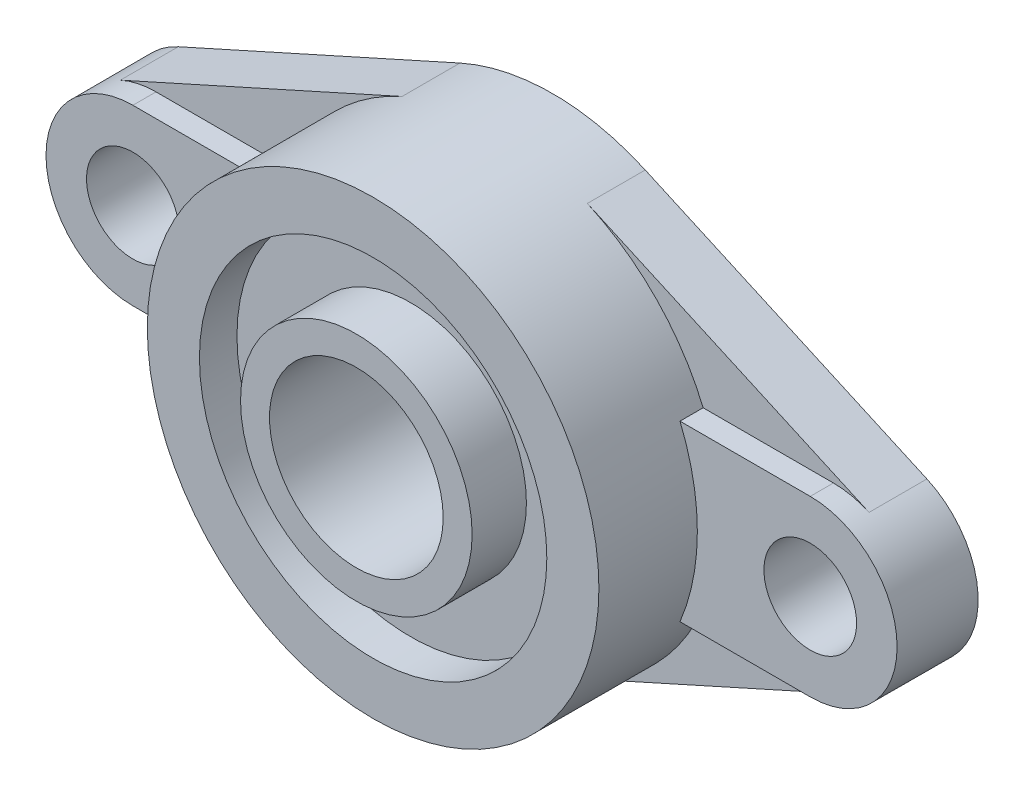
ISO-10303-21;
HEADER;
FILE_DESCRIPTION(('STEP AP214'),'2;1');
FILE_NAME('part.step','',(''),(''),'','','');
FILE_SCHEMA(('AUTOMOTIVE_DESIGN { 1 0 10303 214 1 1 1 1 }'));
ENDSEC;
DATA;
#1=APPLICATION_CONTEXT('core data for automotive mechanical design processes');
#2=APPLICATION_PROTOCOL_DEFINITION('international standard','automotive_design',2000,#1);
#3=PRODUCT_CONTEXT('',#1,'mechanical');
#4=PRODUCT('Part','Part','',(#3));
#5=PRODUCT_RELATED_PRODUCT_CATEGORY('part','',(#4));
#6=PRODUCT_DEFINITION_FORMATION('','',#4);
#7=PRODUCT_DEFINITION_CONTEXT('part definition',#1,'design');
#8=PRODUCT_DEFINITION('design','',#6,#7);
#9=PRODUCT_DEFINITION_SHAPE('','',#8);
#10=(LENGTH_UNIT() NAMED_UNIT(*) SI_UNIT(.MILLI.,.METRE.));
#11=(NAMED_UNIT(*) PLANE_ANGLE_UNIT() SI_UNIT($,.RADIAN.));
#12=(NAMED_UNIT(*) SI_UNIT($,.STERADIAN.) SOLID_ANGLE_UNIT());
#13=UNCERTAINTY_MEASURE_WITH_UNIT(LENGTH_MEASURE(1.E-05),#10,'distance_accuracy_value','');
#14=(GEOMETRIC_REPRESENTATION_CONTEXT(3) GLOBAL_UNCERTAINTY_ASSIGNED_CONTEXT((#13)) GLOBAL_UNIT_ASSIGNED_CONTEXT((#10,
#11,#12)) REPRESENTATION_CONTEXT('',''));
#15=CARTESIAN_POINT('',(0.,0.,0.));
#16=DIRECTION('',(0.,0.,1.));
#17=DIRECTION('',(1.,0.,0.));
#18=AXIS2_PLACEMENT_3D('',#15,#16,#17);
#19=CARTESIAN_POINT('',(0.,15.,33.9));
#20=DIRECTION('',(0.,0.,1.));
#21=DIRECTION('',(1.,0.,0.));
#22=AXIS2_PLACEMENT_3D('',#19,#20,#21);
#23=PLANE('',#22);
#24=CARTESIAN_POINT('',(0.,0.,33.9));
#25=DIRECTION('',(0.,0.,-1.));
#26=DIRECTION('',(-1.,0.,0.));
#27=AXIS2_PLACEMENT_3D('',#24,#25,#26);
#28=CIRCLE('',#27,20.);
#29=CARTESIAN_POINT('',(-20.,0.,33.9));
#30=VERTEX_POINT('',#29);
#31=EDGE_CURVE('E179',#30,#30,#28,.T.);
#32=ORIENTED_EDGE('',*,*,#31,.F.);
#33=EDGE_LOOP('',(#32));
#34=FACE_BOUND('',#33,.T.);
#35=CARTESIAN_POINT('',(0.,0.,33.9));
#36=DIRECTION('',(0.,0.,-1.));
#37=DIRECTION('',(1.,0.,0.));
#38=AXIS2_PLACEMENT_3D('',#35,#36,#37);
#39=CIRCLE('',#38,15.);
#40=CARTESIAN_POINT('',(15.,0.,33.9));
#41=VERTEX_POINT('',#40);
#42=EDGE_CURVE('E383',#41,#41,#39,.T.);
#43=ORIENTED_EDGE('',*,*,#42,.T.);
#44=EDGE_LOOP('',(#43));
#45=FACE_BOUND('',#44,.T.);
#46=ADVANCED_FACE('F17',(#34,#45),#23,.T.);
#47=CARTESIAN_POINT('',(0.,15.,-4.1));
#48=DIRECTION('',(0.,0.,1.));
#49=DIRECTION('',(1.,0.,0.));
#50=AXIS2_PLACEMENT_3D('',#47,#48,#49);
#51=PLANE('',#50);
#52=CARTESIAN_POINT('',(0.,0.,-4.1));
#53=DIRECTION('',(0.,0.,-1.));
#54=DIRECTION('',(-1.,0.,0.));
#55=AXIS2_PLACEMENT_3D('',#52,#53,#54);
#56=CIRCLE('',#55,20.);
#57=CARTESIAN_POINT('',(-20.,0.,-4.1));
#58=VERTEX_POINT('',#57);
#59=EDGE_CURVE('E163',#58,#58,#56,.T.);
#60=ORIENTED_EDGE('',*,*,#59,.T.);
#61=EDGE_LOOP('',(#60));
#62=FACE_BOUND('',#61,.T.);
#63=CARTESIAN_POINT('',(0.,0.,-4.1));
#64=DIRECTION('',(0.,0.,1.));
#65=DIRECTION('',(1.,0.,0.));
#66=AXIS2_PLACEMENT_3D('',#63,#64,#65);
#67=CIRCLE('',#66,15.);
#68=CARTESIAN_POINT('',(15.,0.,-4.09999999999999));
#69=VERTEX_POINT('',#68);
#70=EDGE_CURVE('E386',#69,#69,#67,.F.);
#71=ORIENTED_EDGE('',*,*,#70,.F.);
#72=EDGE_LOOP('',(#71));
#73=FACE_BOUND('',#72,.T.);
#74=ADVANCED_FACE('F396',(#62,#73),#51,.F.);
#75=CARTESIAN_POINT('',(-58.5,0.,9.99999999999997));
#76=DIRECTION('',(0.,0.,-1.));
#77=DIRECTION('',(-1.,0.,0.));
#78=AXIS2_PLACEMENT_3D('',#75,#76,#77);
#79=PLANE('',#78);
#80=CARTESIAN_POINT('',(0.,0.,10.));
#81=DIRECTION('',(0.,0.,-1.));
#82=DIRECTION('',(-1.,0.,0.));
#83=AXIS2_PLACEMENT_3D('',#80,#81,#82);
#84=CIRCLE('',#83,39.);
#85=CARTESIAN_POINT('',(-16.,-35.5668384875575,10.));
#86=VERTEX_POINT('',#85);
#87=CARTESIAN_POINT('',(-36.,-15.,9.99999999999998));
#88=VERTEX_POINT('',#87);
#89=EDGE_CURVE('E136',#86,#88,#84,.T.);
#90=ORIENTED_EDGE('',*,*,#89,.T.);
#91=DIRECTION('',(-1.,0.,0.));
#92=VECTOR('',#91,1.);
#93=CARTESIAN_POINT('',(-58.5,-15.0000000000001,9.99999999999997));
#94=LINE('',#93,#92);
#95=CARTESIAN_POINT('',(-58.5,-15.0000000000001,9.99999999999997));
#96=VERTEX_POINT('',#95);
#97=EDGE_CURVE('E193',#88,#96,#94,.T.);
#98=ORIENTED_EDGE('',*,*,#97,.T.);
#99=CARTESIAN_POINT('',(-58.5,0.,9.99999999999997));
#100=DIRECTION('',(0.,0.,-1.));
#101=DIRECTION('',(1.,0.,0.));
#102=AXIS2_PLACEMENT_3D('',#99,#100,#101);
#103=CIRCLE('',#102,15.);
#104=CARTESIAN_POINT('',(-64.6538461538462,-13.6795532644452,9.99999999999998));
#105=VERTEX_POINT('',#104);
#106=EDGE_CURVE('E139',#96,#105,#103,.T.);
#107=ORIENTED_EDGE('',*,*,#106,.T.);
#108=DIRECTION('',(-0.911970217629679,0.41025641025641,0.));
#109=VECTOR('',#108,1.);
#110=CARTESIAN_POINT('',(-64.6538461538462,-13.6795532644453,9.99999999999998));
#111=LINE('',#110,#109);
#112=EDGE_CURVE('E132',#86,#105,#111,.T.);
#113=ORIENTED_EDGE('',*,*,#112,.F.);
#114=EDGE_LOOP('',(#90,#98,#107,#113));
#115=FACE_BOUND('',#114,.T.);
#116=ADVANCED_FACE('F134',(#115),#79,.F.);
#117=CARTESIAN_POINT('',(36.,-15.,10.));
#118=VERTEX_POINT('',#117);
#119=CARTESIAN_POINT('',(16.,-35.5668384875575,10.));
#120=VERTEX_POINT('',#119);
#121=EDGE_CURVE('E160',#118,#120,#84,.T.);
#122=ORIENTED_EDGE('',*,*,#121,.T.);
#123=DIRECTION('',(-0.911970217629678,-0.410256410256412,0.));
#124=VECTOR('',#123,1.);
#125=CARTESIAN_POINT('',(64.6538461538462,-13.6795532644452,10.));
#126=LINE('',#125,#124);
#127=CARTESIAN_POINT('',(64.6538461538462,-13.6795532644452,10.));
#128=VERTEX_POINT('',#127);
#129=EDGE_CURVE('E143',#128,#120,#126,.T.);
#130=ORIENTED_EDGE('',*,*,#129,.F.);
#131=CARTESIAN_POINT('',(58.5,0.,10.));
#132=DIRECTION('',(0.,0.,-1.));
#133=DIRECTION('',(-1.,0.,0.));
#134=AXIS2_PLACEMENT_3D('',#131,#132,#133);
#135=CIRCLE('',#134,15.);
#136=CARTESIAN_POINT('',(58.5,-15.,10.));
#137=VERTEX_POINT('',#136);
#138=EDGE_CURVE('E242',#128,#137,#135,.T.);
#139=ORIENTED_EDGE('',*,*,#138,.T.);
#140=EDGE_CURVE('E189',#137,#118,#94,.T.);
#141=ORIENTED_EDGE('',*,*,#140,.T.);
#142=EDGE_LOOP('',(#122,#130,#139,#141));
#143=FACE_BOUND('',#142,.T.);
#144=ADVANCED_FACE('F358',(#143),#79,.F.);
#145=CARTESIAN_POINT('',(16.,35.5668384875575,10.));
#146=VERTEX_POINT('',#145);
#147=CARTESIAN_POINT('',(36.,15.,10.));
#148=VERTEX_POINT('',#147);
#149=EDGE_CURVE('E33',#146,#148,#84,.T.);
#150=ORIENTED_EDGE('',*,*,#149,.T.);
#151=DIRECTION('',(1.,0.,0.));
#152=VECTOR('',#151,1.);
#153=CARTESIAN_POINT('',(-58.5,15.,9.99999999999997));
#154=LINE('',#153,#152);
#155=CARTESIAN_POINT('',(58.5,15.,10.));
#156=VERTEX_POINT('',#155);
#157=EDGE_CURVE('E188',#148,#156,#154,.T.);
#158=ORIENTED_EDGE('',*,*,#157,.T.);
#159=CARTESIAN_POINT('',(64.6538461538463,13.6795532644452,10.));
#160=VERTEX_POINT('',#159);
#161=EDGE_CURVE('E197',#156,#160,#135,.T.);
#162=ORIENTED_EDGE('',*,*,#161,.T.);
#163=DIRECTION('',(0.911970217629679,-0.41025641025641,0.));
#164=VECTOR('',#163,1.);
#165=CARTESIAN_POINT('',(16.,35.5668384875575,10.));
#166=LINE('',#165,#164);
#167=EDGE_CURVE('E256',#146,#160,#166,.T.);
#168=ORIENTED_EDGE('',*,*,#167,.F.);
#169=EDGE_LOOP('',(#150,#158,#162,#168));
#170=FACE_BOUND('',#169,.T.);
#171=ADVANCED_FACE('F418',(#170),#79,.F.);
#172=CARTESIAN_POINT('',(-36.,15.,9.99999999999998));
#173=VERTEX_POINT('',#172);
#174=CARTESIAN_POINT('',(-16.,35.5668384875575,9.99999999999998));
#175=VERTEX_POINT('',#174);
#176=EDGE_CURVE('E161',#173,#175,#84,.T.);
#177=ORIENTED_EDGE('',*,*,#176,.T.);
#178=DIRECTION('',(0.911970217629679,0.410256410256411,0.));
#179=VECTOR('',#178,1.);
#180=CARTESIAN_POINT('',(-64.6538461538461,13.6795532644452,9.99999999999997));
#181=LINE('',#180,#179);
#182=CARTESIAN_POINT('',(-64.6538461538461,13.6795532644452,9.99999999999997));
#183=VERTEX_POINT('',#182);
#184=EDGE_CURVE('E265',#183,#175,#181,.T.);
#185=ORIENTED_EDGE('',*,*,#184,.F.);
#186=CARTESIAN_POINT('',(-58.5,15.,9.99999999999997));
#187=VERTEX_POINT('',#186);
#188=EDGE_CURVE('E247',#183,#187,#103,.T.);
#189=ORIENTED_EDGE('',*,*,#188,.T.);
#190=EDGE_CURVE('E194',#187,#173,#154,.T.);
#191=ORIENTED_EDGE('',*,*,#190,.T.);
#192=EDGE_LOOP('',(#177,#185,#189,#191));
#193=FACE_BOUND('',#192,.T.);
#194=ADVANCED_FACE('F319',(#193),#79,.F.);
#195=CARTESIAN_POINT('',(-58.5,0.,0.));
#196=DIRECTION('',(0.,0.,-1.));
#197=DIRECTION('',(-1.,0.,0.));
#198=AXIS2_PLACEMENT_3D('',#195,#196,#197);
#199=PLANE('',#198);
#200=CARTESIAN_POINT('',(58.5,0.,0.));
#201=DIRECTION('',(0.,0.,1.));
#202=DIRECTION('',(1.,0.,0.));
#203=AXIS2_PLACEMENT_3D('',#200,#201,#202);
#204=CIRCLE('',#203,8.);
#205=CARTESIAN_POINT('',(66.5,0.,0.));
#206=VERTEX_POINT('',#205);
#207=EDGE_CURVE('E269',#206,#206,#204,.T.);
#208=ORIENTED_EDGE('',*,*,#207,.T.);
#209=EDGE_LOOP('',(#208));
#210=FACE_BOUND('',#209,.T.);
#211=CARTESIAN_POINT('',(-58.5,0.,0.));
#212=DIRECTION('',(0.,0.,-1.));
#213=DIRECTION('',(1.,0.,0.));
#214=AXIS2_PLACEMENT_3D('',#211,#212,#213);
#215=CIRCLE('',#214,15.);
#216=CARTESIAN_POINT('',(-64.6538461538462,-13.6795532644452,0.));
#217=VERTEX_POINT('',#216);
#218=CARTESIAN_POINT('',(-64.6538461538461,13.6795532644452,0.));
#219=VERTEX_POINT('',#218);
#220=EDGE_CURVE('E228',#217,#219,#215,.T.);
#221=ORIENTED_EDGE('',*,*,#220,.T.);
#222=DIRECTION('',(0.911970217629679,0.410256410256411,0.));
#223=VECTOR('',#222,1.);
#224=CARTESIAN_POINT('',(-64.6538461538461,13.6795532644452,0.));
#225=LINE('',#224,#223);
#226=CARTESIAN_POINT('',(-16.,35.5668384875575,0.));
#227=VERTEX_POINT('',#226);
#228=EDGE_CURVE('E300',#219,#227,#225,.T.);
#229=ORIENTED_EDGE('',*,*,#228,.T.);
#230=CARTESIAN_POINT('',(0.,0.,0.));
#231=DIRECTION('',(0.,0.,-1.));
#232=DIRECTION('',(1.,0.,0.));
#233=AXIS2_PLACEMENT_3D('',#230,#231,#232);
#234=CIRCLE('',#233,39.);
#235=CARTESIAN_POINT('',(16.,35.5668384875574,0.));
#236=VERTEX_POINT('',#235);
#237=EDGE_CURVE('E305',#227,#236,#234,.T.);
#238=ORIENTED_EDGE('',*,*,#237,.T.);
#239=DIRECTION('',(0.911970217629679,-0.41025641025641,0.));
#240=VECTOR('',#239,1.);
#241=CARTESIAN_POINT('',(16.,35.5668384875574,0.));
#242=LINE('',#241,#240);
#243=CARTESIAN_POINT('',(64.6538461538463,13.6795532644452,0.));
#244=VERTEX_POINT('',#243);
#245=EDGE_CURVE('E325',#236,#244,#242,.T.);
#246=ORIENTED_EDGE('',*,*,#245,.T.);
#247=CARTESIAN_POINT('',(58.5,0.,0.));
#248=DIRECTION('',(0.,0.,-1.));
#249=DIRECTION('',(-1.,0.,0.));
#250=AXIS2_PLACEMENT_3D('',#247,#248,#249);
#251=CIRCLE('',#250,15.);
#252=CARTESIAN_POINT('',(64.6538461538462,-13.6795532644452,0.));
#253=VERTEX_POINT('',#252);
#254=EDGE_CURVE('E330',#244,#253,#251,.T.);
#255=ORIENTED_EDGE('',*,*,#254,.T.);
#256=DIRECTION('',(-0.911970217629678,-0.410256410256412,0.));
#257=VECTOR('',#256,1.);
#258=CARTESIAN_POINT('',(64.6538461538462,-13.6795532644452,0.));
#259=LINE('',#258,#257);
#260=CARTESIAN_POINT('',(16.,-35.5668384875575,0.));
#261=VERTEX_POINT('',#260);
#262=EDGE_CURVE('E335',#253,#261,#259,.T.);
#263=ORIENTED_EDGE('',*,*,#262,.T.);
#264=CARTESIAN_POINT('',(0.,0.,0.));
#265=DIRECTION('',(0.,0.,-1.));
#266=DIRECTION('',(1.,0.,0.));
#267=AXIS2_PLACEMENT_3D('',#264,#265,#266);
#268=CIRCLE('',#267,39.);
#269=CARTESIAN_POINT('',(-16.,-35.5668384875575,0.));
#270=VERTEX_POINT('',#269);
#271=EDGE_CURVE('E294',#261,#270,#268,.T.);
#272=ORIENTED_EDGE('',*,*,#271,.T.);
#273=DIRECTION('',(-0.911970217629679,0.41025641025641,0.));
#274=VECTOR('',#273,1.);
#275=CARTESIAN_POINT('',(-64.6538461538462,-13.6795532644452,0.));
#276=LINE('',#275,#274);
#277=EDGE_CURVE('E149',#270,#217,#276,.T.);
#278=ORIENTED_EDGE('',*,*,#277,.T.);
#279=EDGE_LOOP('',(#221,#229,#238,#246,#255,#263,#272,#278));
#280=FACE_BOUND('',#279,.T.);
#281=CARTESIAN_POINT('',(-58.5,0.,0.));
#282=DIRECTION('',(0.,0.,1.));
#283=DIRECTION('',(1.,0.,0.));
#284=AXIS2_PLACEMENT_3D('',#281,#282,#283);
#285=CIRCLE('',#284,8.);
#286=CARTESIAN_POINT('',(-50.5,0.,0.));
#287=VERTEX_POINT('',#286);
#288=EDGE_CURVE('E276',#287,#287,#285,.T.);
#289=ORIENTED_EDGE('',*,*,#288,.T.);
#290=EDGE_LOOP('',(#289));
#291=FACE_BOUND('',#290,.T.);
#292=CARTESIAN_POINT('',(0.,0.,0.));
#293=DIRECTION('',(0.,0.,-1.));
#294=DIRECTION('',(-1.,0.,0.));
#295=AXIS2_PLACEMENT_3D('',#292,#293,#294);
#296=CIRCLE('',#295,20.);
#297=CARTESIAN_POINT('',(-20.,0.,0.));
#298=VERTEX_POINT('',#297);
#299=EDGE_CURVE('E11',#298,#298,#296,.F.);
#300=ORIENTED_EDGE('',*,*,#299,.T.);
#301=EDGE_LOOP('',(#300));
#302=FACE_BOUND('',#301,.T.);
#303=ADVANCED_FACE('F290',(#210,#280,#291,#302),#199,.T.);
#304=CARTESIAN_POINT('',(-58.5,14.9999999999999,14.));
#305=DIRECTION('',(0.,1.,0.));
#306=DIRECTION('',(0.,0.,1.));
#307=AXIS2_PLACEMENT_3D('',#304,#305,#306);
#308=PLANE('',#307);
#309=ORIENTED_EDGE('',*,*,#157,.F.);
#310=DIRECTION('',(0.,0.,-1.));
#311=VECTOR('',#310,1.);
#312=CARTESIAN_POINT('',(36.,15.,44.2691872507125));
#313=LINE('',#312,#311);
#314=CARTESIAN_POINT('',(36.,15.,14.));
#315=VERTEX_POINT('',#314);
#316=EDGE_CURVE('E186',#148,#315,#313,.F.);
#317=ORIENTED_EDGE('',*,*,#316,.T.);
#318=DIRECTION('',(1.,0.,0.));
#319=VECTOR('',#318,1.);
#320=CARTESIAN_POINT('',(-58.5,14.9999999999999,14.));
#321=LINE('',#320,#319);
#322=CARTESIAN_POINT('',(58.5,15.,14.));
#323=VERTEX_POINT('',#322);
#324=EDGE_CURVE('E211',#315,#323,#321,.T.);
#325=ORIENTED_EDGE('',*,*,#324,.T.);
#326=DIRECTION('',(0.,0.,-1.));
#327=VECTOR('',#326,1.);
#328=CARTESIAN_POINT('',(58.5,15.,14.));
#329=LINE('',#328,#327);
#330=EDGE_CURVE('E225',#323,#156,#329,.T.);
#331=ORIENTED_EDGE('',*,*,#330,.T.);
#332=EDGE_LOOP('',(#309,#317,#325,#331));
#333=FACE_BOUND('',#332,.T.);
#334=ADVANCED_FACE('F408',(#333),#308,.T.);
#335=CARTESIAN_POINT('',(-58.5,14.9999999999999,14.));
#336=VERTEX_POINT('',#335);
#337=CARTESIAN_POINT('',(-36.,15.,14.));
#338=VERTEX_POINT('',#337);
#339=EDGE_CURVE('E202',#336,#338,#321,.T.);
#340=ORIENTED_EDGE('',*,*,#339,.T.);
#341=DIRECTION('',(0.,0.,-1.));
#342=VECTOR('',#341,1.);
#343=CARTESIAN_POINT('',(-36.,15.,44.2691872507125));
#344=LINE('',#343,#342);
#345=EDGE_CURVE('E41',#338,#173,#344,.T.);
#346=ORIENTED_EDGE('',*,*,#345,.T.);
#347=ORIENTED_EDGE('',*,*,#190,.F.);
#348=DIRECTION('',(0.,0.,-1.));
#349=VECTOR('',#348,1.);
#350=CARTESIAN_POINT('',(-58.5,14.9999999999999,14.));
#351=LINE('',#350,#349);
#352=EDGE_CURVE('E217',#336,#187,#351,.T.);
#353=ORIENTED_EDGE('',*,*,#352,.F.);
#354=EDGE_LOOP('',(#340,#346,#347,#353));
#355=FACE_BOUND('',#354,.T.);
#356=ADVANCED_FACE('F373',(#355),#308,.T.);
#357=CARTESIAN_POINT('',(-58.5,-15.,14.));
#358=DIRECTION('',(0.,-1.,0.));
#359=DIRECTION('',(0.,0.,-1.));
#360=AXIS2_PLACEMENT_3D('',#357,#358,#359);
#361=PLANE('',#360);
#362=ORIENTED_EDGE('',*,*,#97,.F.);
#363=DIRECTION('',(0.,0.,-1.));
#364=VECTOR('',#363,1.);
#365=CARTESIAN_POINT('',(-36.,-15.,44.2691872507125));
#366=LINE('',#365,#364);
#367=CARTESIAN_POINT('',(-36.,-15.,14.));
#368=VERTEX_POINT('',#367);
#369=EDGE_CURVE('E159',#88,#368,#366,.F.);
#370=ORIENTED_EDGE('',*,*,#369,.T.);
#371=DIRECTION('',(-1.,0.,0.));
#372=VECTOR('',#371,1.);
#373=CARTESIAN_POINT('',(-58.5,-15.,14.));
#374=LINE('',#373,#372);
#375=CARTESIAN_POINT('',(-58.5,-15.,14.));
#376=VERTEX_POINT('',#375);
#377=EDGE_CURVE('E201',#368,#376,#374,.T.);
#378=ORIENTED_EDGE('',*,*,#377,.T.);
#379=DIRECTION('',(0.,0.,-1.));
#380=VECTOR('',#379,1.);
#381=CARTESIAN_POINT('',(-58.5,-15.,14.));
#382=LINE('',#381,#380);
#383=EDGE_CURVE('E220',#376,#96,#382,.T.);
#384=ORIENTED_EDGE('',*,*,#383,.T.);
#385=EDGE_LOOP('',(#362,#370,#378,#384));
#386=FACE_BOUND('',#385,.T.);
#387=ADVANCED_FACE('F376',(#386),#361,.T.);
#388=CARTESIAN_POINT('',(58.5,-15.,14.));
#389=VERTEX_POINT('',#388);
#390=CARTESIAN_POINT('',(36.,-15.,14.));
#391=VERTEX_POINT('',#390);
#392=EDGE_CURVE('E203',#389,#391,#374,.T.);
#393=ORIENTED_EDGE('',*,*,#392,.T.);
#394=DIRECTION('',(0.,0.,-1.));
#395=VECTOR('',#394,1.);
#396=CARTESIAN_POINT('',(36.,-15.,44.2691872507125));
#397=LINE('',#396,#395);
#398=EDGE_CURVE('E184',#391,#118,#397,.T.);
#399=ORIENTED_EDGE('',*,*,#398,.T.);
#400=ORIENTED_EDGE('',*,*,#140,.F.);
#401=DIRECTION('',(0.,0.,-1.));
#402=VECTOR('',#401,1.);
#403=CARTESIAN_POINT('',(58.5,-15.,14.));
#404=LINE('',#403,#402);
#405=EDGE_CURVE('E223',#389,#137,#404,.T.);
#406=ORIENTED_EDGE('',*,*,#405,.F.);
#407=EDGE_LOOP('',(#393,#399,#400,#406));
#408=FACE_BOUND('',#407,.T.);
#409=ADVANCED_FACE('F361',(#408),#361,.T.);
#410=CARTESIAN_POINT('',(58.5,0.,14.));
#411=DIRECTION('',(0.,0.,-1.));
#412=DIRECTION('',(-1.,0.,0.));
#413=AXIS2_PLACEMENT_3D('',#410,#411,#412);
#414=PLANE('',#413);
#415=CARTESIAN_POINT('',(58.5,0.,14.));
#416=DIRECTION('',(0.,0.,1.));
#417=DIRECTION('',(1.,0.,0.));
#418=AXIS2_PLACEMENT_3D('',#415,#416,#417);
#419=CIRCLE('',#418,8.);
#420=CARTESIAN_POINT('',(66.5,0.,14.));
#421=VERTEX_POINT('',#420);
#422=EDGE_CURVE('E214',#421,#421,#419,.T.);
#423=ORIENTED_EDGE('',*,*,#422,.F.);
#424=EDGE_LOOP('',(#423));
#425=FACE_BOUND('',#424,.T.);
#426=CARTESIAN_POINT('',(0.,0.,14.));
#427=DIRECTION('',(0.,0.,-1.));
#428=DIRECTION('',(-1.,0.,0.));
#429=AXIS2_PLACEMENT_3D('',#426,#427,#428);
#430=CIRCLE('',#429,39.);
#431=EDGE_CURVE('E26',#391,#315,#430,.F.);
#432=ORIENTED_EDGE('',*,*,#431,.F.);
#433=ORIENTED_EDGE('',*,*,#392,.F.);
#434=CARTESIAN_POINT('',(58.5,0.,14.));
#435=DIRECTION('',(0.,0.,-1.));
#436=DIRECTION('',(-1.,0.,0.));
#437=AXIS2_PLACEMENT_3D('',#434,#435,#436);
#438=CIRCLE('',#437,15.);
#439=EDGE_CURVE('E198',#323,#389,#438,.T.);
#440=ORIENTED_EDGE('',*,*,#439,.F.);
#441=ORIENTED_EDGE('',*,*,#324,.F.);
#442=EDGE_LOOP('',(#432,#433,#440,#441));
#443=FACE_BOUND('',#442,.T.);
#444=ADVANCED_FACE('F365',(#425,#443),#414,.F.);
#445=CARTESIAN_POINT('',(-58.5,0.,14.));
#446=DIRECTION('',(0.,0.,1.));
#447=DIRECTION('',(1.,0.,0.));
#448=AXIS2_PLACEMENT_3D('',#445,#446,#447);
#449=CIRCLE('',#448,8.);
#450=CARTESIAN_POINT('',(-50.5,0.,14.));
#451=VERTEX_POINT('',#450);
#452=EDGE_CURVE('E209',#451,#451,#449,.T.);
#453=ORIENTED_EDGE('',*,*,#452,.F.);
#454=EDGE_LOOP('',(#453));
#455=FACE_BOUND('',#454,.T.);
#456=EDGE_CURVE('E21',#338,#368,#430,.F.);
#457=ORIENTED_EDGE('',*,*,#456,.F.);
#458=ORIENTED_EDGE('',*,*,#339,.F.);
#459=CARTESIAN_POINT('',(-58.5,0.,14.));
#460=DIRECTION('',(0.,0.,-1.));
#461=DIRECTION('',(1.,0.,0.));
#462=AXIS2_PLACEMENT_3D('',#459,#460,#461);
#463=CIRCLE('',#462,15.);
#464=EDGE_CURVE('E206',#376,#336,#463,.T.);
#465=ORIENTED_EDGE('',*,*,#464,.F.);
#466=ORIENTED_EDGE('',*,*,#377,.F.);
#467=EDGE_LOOP('',(#457,#458,#465,#466));
#468=FACE_BOUND('',#467,.T.);
#469=ADVANCED_FACE('F371',(#455,#468),#414,.F.);
#470=CARTESIAN_POINT('',(-58.5,0.,9.99999999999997));
#471=DIRECTION('',(0.,0.,-1.));
#472=DIRECTION('',(-1.,0.,0.));
#473=AXIS2_PLACEMENT_3D('',#470,#471,#472);
#474=CYLINDRICAL_SURFACE('',#473,15.);
#475=ORIENTED_EDGE('',*,*,#220,.F.);
#476=DIRECTION('',(0.,0.,-1.));
#477=VECTOR('',#476,1.);
#478=CARTESIAN_POINT('',(-64.6538461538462,-13.6795532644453,9.99999999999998));
#479=LINE('',#478,#477);
#480=EDGE_CURVE('E142',#105,#217,#479,.T.);
#481=ORIENTED_EDGE('',*,*,#480,.F.);
#482=ORIENTED_EDGE('',*,*,#106,.F.);
#483=ORIENTED_EDGE('',*,*,#383,.F.);
#484=ORIENTED_EDGE('',*,*,#464,.T.);
#485=ORIENTED_EDGE('',*,*,#352,.T.);
#486=ORIENTED_EDGE('',*,*,#188,.F.);
#487=DIRECTION('',(0.,0.,-1.));
#488=VECTOR('',#487,1.);
#489=CARTESIAN_POINT('',(-64.6538461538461,13.6795532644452,9.99999999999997));
#490=LINE('',#489,#488);
#491=EDGE_CURVE('E297',#183,#219,#490,.T.);
#492=ORIENTED_EDGE('',*,*,#491,.T.);
#493=EDGE_LOOP('',(#475,#481,#482,#483,#484,#485,#486,#492));
#494=FACE_BOUND('',#493,.T.);
#495=ADVANCED_FACE('F19',(#494),#474,.T.);
#496=CARTESIAN_POINT('',(-64.6538461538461,13.6795532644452,9.99999999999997));
#497=DIRECTION('',(-0.41025641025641,0.911970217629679,0.));
#498=DIRECTION('',(-0.911970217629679,-0.410256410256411,0.));
#499=AXIS2_PLACEMENT_3D('',#496,#497,#498);
#500=PLANE('',#499);
#501=ORIENTED_EDGE('',*,*,#228,.F.);
#502=ORIENTED_EDGE('',*,*,#491,.F.);
#503=ORIENTED_EDGE('',*,*,#184,.T.);
#504=DIRECTION('',(0.,0.,-1.));
#505=VECTOR('',#504,1.);
#506=CARTESIAN_POINT('',(-16.,35.5668384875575,9.99999999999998));
#507=LINE('',#506,#505);
#508=EDGE_CURVE('E236',#175,#227,#507,.T.);
#509=ORIENTED_EDGE('',*,*,#508,.T.);
#510=EDGE_LOOP('',(#501,#502,#503,#509));
#511=FACE_BOUND('',#510,.T.);
#512=ADVANCED_FACE('F321',(#511),#500,.T.);
#513=CARTESIAN_POINT('',(16.,35.5668384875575,10.));
#514=DIRECTION('',(0.41025641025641,0.911970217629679,0.));
#515=DIRECTION('',(-0.911970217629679,0.41025641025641,0.));
#516=AXIS2_PLACEMENT_3D('',#513,#514,#515);
#517=PLANE('',#516);
#518=ORIENTED_EDGE('',*,*,#245,.F.);
#519=DIRECTION('',(0.,0.,-1.));
#520=VECTOR('',#519,1.);
#521=CARTESIAN_POINT('',(16.,35.5668384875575,10.));
#522=LINE('',#521,#520);
#523=EDGE_CURVE('E260',#146,#236,#522,.T.);
#524=ORIENTED_EDGE('',*,*,#523,.F.);
#525=ORIENTED_EDGE('',*,*,#167,.T.);
#526=DIRECTION('',(0.,0.,-1.));
#527=VECTOR('',#526,1.);
#528=CARTESIAN_POINT('',(64.6538461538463,13.6795532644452,10.));
#529=LINE('',#528,#527);
#530=EDGE_CURVE('E251',#160,#244,#529,.T.);
#531=ORIENTED_EDGE('',*,*,#530,.T.);
#532=EDGE_LOOP('',(#518,#524,#525,#531));
#533=FACE_BOUND('',#532,.T.);
#534=ADVANCED_FACE('F665',(#533),#517,.T.);
#535=CARTESIAN_POINT('',(58.5,0.,10.));
#536=DIRECTION('',(0.,0.,-1.));
#537=DIRECTION('',(-1.,0.,0.));
#538=AXIS2_PLACEMENT_3D('',#535,#536,#537);
#539=CYLINDRICAL_SURFACE('',#538,15.);
#540=ORIENTED_EDGE('',*,*,#254,.F.);
#541=ORIENTED_EDGE('',*,*,#530,.F.);
#542=ORIENTED_EDGE('',*,*,#161,.F.);
#543=ORIENTED_EDGE('',*,*,#330,.F.);
#544=ORIENTED_EDGE('',*,*,#439,.T.);
#545=ORIENTED_EDGE('',*,*,#405,.T.);
#546=ORIENTED_EDGE('',*,*,#138,.F.);
#547=DIRECTION('',(0.,0.,-1.));
#548=VECTOR('',#547,1.);
#549=CARTESIAN_POINT('',(64.6538461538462,-13.6795532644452,10.));
#550=LINE('',#549,#548);
#551=EDGE_CURVE('E249',#128,#253,#550,.T.);
#552=ORIENTED_EDGE('',*,*,#551,.T.);
#553=EDGE_LOOP('',(#540,#541,#542,#543,#544,#545,#546,#552));
#554=FACE_BOUND('',#553,.T.);
#555=ADVANCED_FACE('F654',(#554),#539,.T.);
#556=CARTESIAN_POINT('',(64.6538461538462,-13.6795532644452,10.));
#557=DIRECTION('',(0.410256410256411,-0.911970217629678,0.));
#558=DIRECTION('',(0.911970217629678,0.410256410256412,0.));
#559=AXIS2_PLACEMENT_3D('',#556,#557,#558);
#560=PLANE('',#559);
#561=ORIENTED_EDGE('',*,*,#262,.F.);
#562=ORIENTED_EDGE('',*,*,#551,.F.);
#563=ORIENTED_EDGE('',*,*,#129,.T.);
#564=DIRECTION('',(0.,0.,-1.));
#565=VECTOR('',#564,1.);
#566=CARTESIAN_POINT('',(16.,-35.5668384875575,10.));
#567=LINE('',#566,#565);
#568=EDGE_CURVE('E153',#120,#261,#567,.T.);
#569=ORIENTED_EDGE('',*,*,#568,.T.);
#570=EDGE_LOOP('',(#561,#562,#563,#569));
#571=FACE_BOUND('',#570,.T.);
#572=ADVANCED_FACE('F351',(#571),#560,.T.);
#573=CARTESIAN_POINT('',(0.,0.,10.));
#574=DIRECTION('',(0.,0.,-1.));
#575=DIRECTION('',(-1.,0.,0.));
#576=AXIS2_PLACEMENT_3D('',#573,#574,#575);
#577=CYLINDRICAL_SURFACE('',#576,39.);
#578=ORIENTED_EDGE('',*,*,#149,.F.);
#579=ORIENTED_EDGE('',*,*,#523,.T.);
#580=ORIENTED_EDGE('',*,*,#237,.F.);
#581=ORIENTED_EDGE('',*,*,#508,.F.);
#582=ORIENTED_EDGE('',*,*,#176,.F.);
#583=ORIENTED_EDGE('',*,*,#345,.F.);
#584=ORIENTED_EDGE('',*,*,#456,.T.);
#585=ORIENTED_EDGE('',*,*,#369,.F.);
#586=ORIENTED_EDGE('',*,*,#89,.F.);
#587=DIRECTION('',(0.,0.,-1.));
#588=VECTOR('',#587,1.);
#589=CARTESIAN_POINT('',(-16.,-35.5668384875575,10.));
#590=LINE('',#589,#588);
#591=EDGE_CURVE('E146',#86,#270,#590,.T.);
#592=ORIENTED_EDGE('',*,*,#591,.T.);
#593=ORIENTED_EDGE('',*,*,#271,.F.);
#594=ORIENTED_EDGE('',*,*,#568,.F.);
#595=ORIENTED_EDGE('',*,*,#121,.F.);
#596=ORIENTED_EDGE('',*,*,#398,.F.);
#597=ORIENTED_EDGE('',*,*,#431,.T.);
#598=ORIENTED_EDGE('',*,*,#316,.F.);
#599=EDGE_LOOP('',(#578,#579,#580,#581,#582,#583,#584,#585,#586,#592,#593,#594,#595,#596,#597,#598));
#600=FACE_BOUND('',#599,.T.);
#601=CARTESIAN_POINT('',(0.,0.,31.));
#602=DIRECTION('',(0.,0.,-1.));
#603=DIRECTION('',(-1.,0.,0.));
#604=AXIS2_PLACEMENT_3D('',#601,#602,#603);
#605=CIRCLE('',#604,39.);
#606=CARTESIAN_POINT('',(-39.,0.,31.));
#607=VERTEX_POINT('',#606);
#608=EDGE_CURVE('E167',#607,#607,#605,.T.);
#609=ORIENTED_EDGE('',*,*,#608,.T.);
#610=EDGE_LOOP('',(#609));
#611=FACE_BOUND('',#610,.T.);
#612=ADVANCED_FACE('F156',(#600,#611),#577,.T.);
#613=CARTESIAN_POINT('',(-64.6538461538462,-13.6795532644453,9.99999999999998));
#614=DIRECTION('',(-0.410256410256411,-0.911970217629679,0.));
#615=DIRECTION('',(0.911970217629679,-0.41025641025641,0.));
#616=AXIS2_PLACEMENT_3D('',#613,#614,#615);
#617=PLANE('',#616);
#618=ORIENTED_EDGE('',*,*,#277,.F.);
#619=ORIENTED_EDGE('',*,*,#591,.F.);
#620=ORIENTED_EDGE('',*,*,#112,.T.);
#621=ORIENTED_EDGE('',*,*,#480,.T.);
#622=EDGE_LOOP('',(#618,#619,#620,#621));
#623=FACE_BOUND('',#622,.T.);
#624=ADVANCED_FACE('F147',(#623),#617,.T.);
#625=CARTESIAN_POINT('',(-58.5,0.,9.99999999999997));
#626=DIRECTION('',(0.,0.,-1.));
#627=DIRECTION('',(-1.,0.,0.));
#628=AXIS2_PLACEMENT_3D('',#625,#626,#627);
#629=CYLINDRICAL_SURFACE('',#628,8.);
#630=ORIENTED_EDGE('',*,*,#288,.F.);
#631=EDGE_LOOP('',(#630));
#632=FACE_BOUND('',#631,.T.);
#633=ORIENTED_EDGE('',*,*,#452,.T.);
#634=EDGE_LOOP('',(#633));
#635=FACE_BOUND('',#634,.T.);
#636=ADVANCED_FACE('F604',(#632,#635),#629,.F.);
#637=CARTESIAN_POINT('',(58.5,0.,10.));
#638=DIRECTION('',(0.,0.,-1.));
#639=DIRECTION('',(-1.,0.,0.));
#640=AXIS2_PLACEMENT_3D('',#637,#638,#639);
#641=CYLINDRICAL_SURFACE('',#640,8.);
#642=ORIENTED_EDGE('',*,*,#207,.F.);
#643=EDGE_LOOP('',(#642));
#644=FACE_BOUND('',#643,.T.);
#645=ORIENTED_EDGE('',*,*,#422,.T.);
#646=EDGE_LOOP('',(#645));
#647=FACE_BOUND('',#646,.T.);
#648=ADVANCED_FACE('F591',(#644,#647),#641,.F.);
#649=CARTESIAN_POINT('',(0.,39.,31.));
#650=DIRECTION('',(0.,0.,-1.));
#651=DIRECTION('',(-1.,0.,0.));
#652=AXIS2_PLACEMENT_3D('',#649,#650,#651);
#653=PLANE('',#652);
#654=ORIENTED_EDGE('',*,*,#608,.F.);
#655=EDGE_LOOP('',(#654));
#656=FACE_BOUND('',#655,.T.);
#657=CARTESIAN_POINT('',(0.,0.,31.));
#658=DIRECTION('',(0.,0.,-1.));
#659=DIRECTION('',(-1.,0.,0.));
#660=AXIS2_PLACEMENT_3D('',#657,#658,#659);
#661=CIRCLE('',#660,30.);
#662=CARTESIAN_POINT('',(-30.,0.,31.));
#663=VERTEX_POINT('',#662);
#664=EDGE_CURVE('E170',#663,#663,#661,.T.);
#665=ORIENTED_EDGE('',*,*,#664,.T.);
#666=EDGE_LOOP('',(#665));
#667=FACE_BOUND('',#666,.T.);
#668=ADVANCED_FACE('F579',(#656,#667),#653,.F.);
#669=CARTESIAN_POINT('',(0.,0.,44.2691872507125));
#670=DIRECTION('',(0.,0.,-1.));
#671=DIRECTION('',(-1.,0.,0.));
#672=AXIS2_PLACEMENT_3D('',#669,#670,#671);
#673=CYLINDRICAL_SURFACE('',#672,30.);
#674=ORIENTED_EDGE('',*,*,#664,.F.);
#675=EDGE_LOOP('',(#674));
#676=FACE_BOUND('',#675,.T.);
#677=CARTESIAN_POINT('',(0.,0.,24.5205578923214));
#678=DIRECTION('',(0.,0.,-1.));
#679=DIRECTION('',(-1.,0.,0.));
#680=AXIS2_PLACEMENT_3D('',#677,#678,#679);
#681=CIRCLE('',#680,30.);
#682=CARTESIAN_POINT('',(-30.,0.,24.5205578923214));
#683=VERTEX_POINT('',#682);
#684=EDGE_CURVE('E173',#683,#683,#681,.T.);
#685=ORIENTED_EDGE('',*,*,#684,.T.);
#686=EDGE_LOOP('',(#685));
#687=FACE_BOUND('',#686,.T.);
#688=ADVANCED_FACE('F568',(#676,#687),#673,.F.);
#689=CARTESIAN_POINT('',(0.,30.,24.5205578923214));
#690=DIRECTION('',(0.,0.,-1.));
#691=DIRECTION('',(-1.,0.,0.));
#692=AXIS2_PLACEMENT_3D('',#689,#690,#691);
#693=PLANE('',#692);
#694=ORIENTED_EDGE('',*,*,#684,.F.);
#695=EDGE_LOOP('',(#694));
#696=FACE_BOUND('',#695,.T.);
#697=CARTESIAN_POINT('',(0.,0.,24.5205578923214));
#698=DIRECTION('',(0.,0.,-1.));
#699=DIRECTION('',(-1.,0.,0.));
#700=AXIS2_PLACEMENT_3D('',#697,#698,#699);
#701=CIRCLE('',#700,20.);
#702=CARTESIAN_POINT('',(-20.,0.,24.5205578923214));
#703=VERTEX_POINT('',#702);
#704=EDGE_CURVE('E176',#703,#703,#701,.T.);
#705=ORIENTED_EDGE('',*,*,#704,.T.);
#706=EDGE_LOOP('',(#705));
#707=FACE_BOUND('',#706,.T.);
#708=ADVANCED_FACE('F558',(#696,#707),#693,.F.);
#709=CARTESIAN_POINT('',(0.,0.,44.2691872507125));
#710=DIRECTION('',(0.,0.,-1.));
#711=DIRECTION('',(-1.,0.,0.));
#712=AXIS2_PLACEMENT_3D('',#709,#710,#711);
#713=CYLINDRICAL_SURFACE('',#712,20.);
#714=ORIENTED_EDGE('',*,*,#704,.F.);
#715=EDGE_LOOP('',(#714));
#716=FACE_BOUND('',#715,.T.);
#717=ORIENTED_EDGE('',*,*,#31,.T.);
#718=EDGE_LOOP('',(#717));
#719=FACE_BOUND('',#718,.T.);
#720=ADVANCED_FACE('F403',(#716,#719),#713,.T.);
#721=CARTESIAN_POINT('',(0.,0.,44.2691872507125));
#722=DIRECTION('',(0.,0.,-1.));
#723=DIRECTION('',(-1.,0.,0.));
#724=AXIS2_PLACEMENT_3D('',#721,#722,#723);
#725=CYLINDRICAL_SURFACE('',#724,20.);
#726=ORIENTED_EDGE('',*,*,#59,.F.);
#727=EDGE_LOOP('',(#726));
#728=FACE_BOUND('',#727,.T.);
#729=ORIENTED_EDGE('',*,*,#299,.F.);
#730=EDGE_LOOP('',(#729));
#731=FACE_BOUND('',#730,.T.);
#732=ADVANCED_FACE('F399',(#728,#731),#725,.T.);
#733=CARTESIAN_POINT('',(0.,0.,-136.795635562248));
#734=DIRECTION('',(0.,0.,1.));
#735=DIRECTION('',(1.,0.,0.));
#736=AXIS2_PLACEMENT_3D('',#733,#734,#735);
#737=CYLINDRICAL_SURFACE('',#736,15.);
#738=ORIENTED_EDGE('',*,*,#70,.T.);
#739=EDGE_LOOP('',(#738));
#740=FACE_BOUND('',#739,.T.);
#741=ORIENTED_EDGE('',*,*,#42,.F.);
#742=EDGE_LOOP('',(#741));
#743=FACE_BOUND('',#742,.T.);
#744=ADVANCED_FACE('F402',(#740,#743),#737,.F.);
#745=CLOSED_SHELL('',(#46,#74,#116,#144,#171,#194,#303,#334,#356,#387,#409,#444,#469,#495,#512,
#534,#555,#572,#612,#624,#636,#648,#668,#688,#708,#720,#732,#744));
#746=MANIFOLD_SOLID_BREP('B1',#745);
#747=ADVANCED_BREP_SHAPE_REPRESENTATION('',(#18,#746),#14);
#748=SHAPE_DEFINITION_REPRESENTATION(#9,#747);
ENDSEC;
END-ISO-10303-21;
